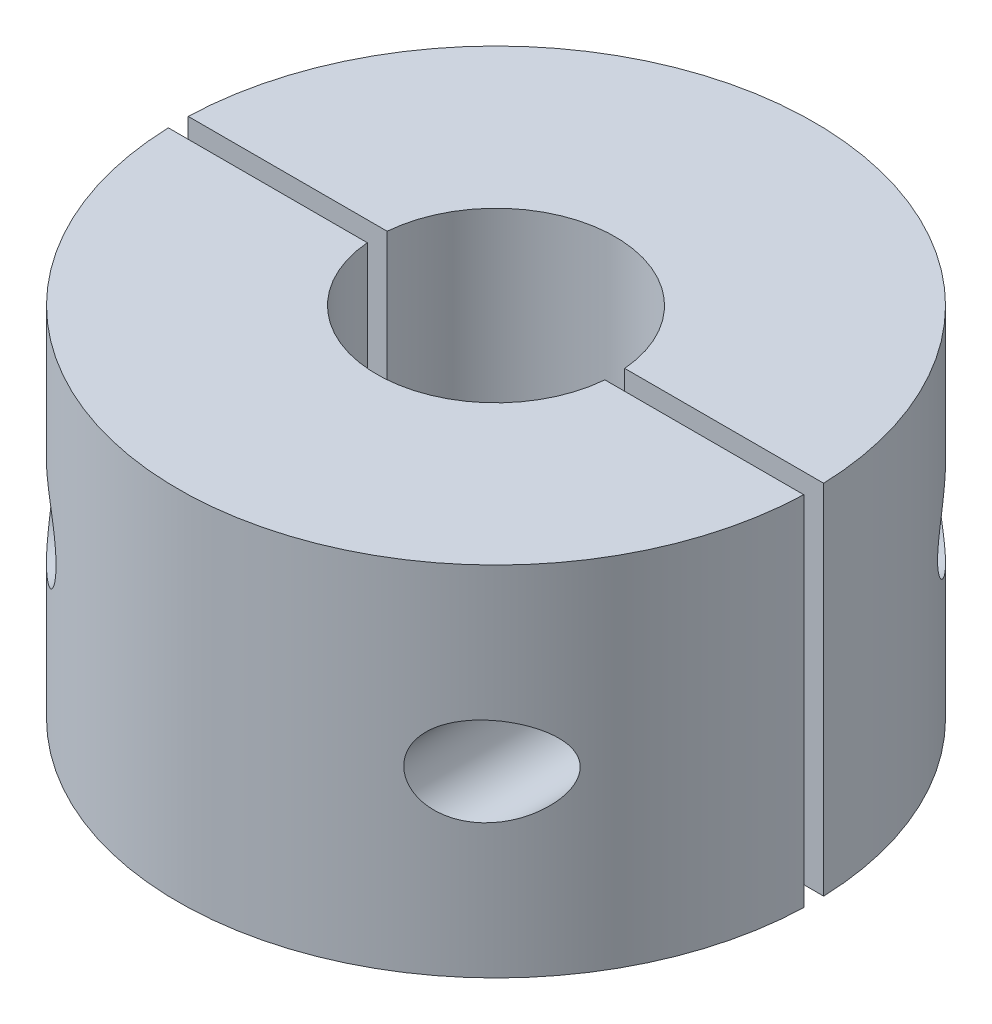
from build123d import *

# Parameters (mm, degrees)
SKETCH_1_R               = 8
EXTRUDE_1_DEPTH          = 9
SKETCH_3_R               = 3
CUT_EXTRUDE_2_DEPTH      = 15.456832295
SKETCH_5_W               = 20
SKETCH_5_H               = 0.5
CUT_EXTRUDE_4_DEPTH      = 15.456832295
CUT_EXTRUDE_5_DEPTH      = 15.454670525
CUT_EXTRUDE_5_DEPTH_BACK = 15.454670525
SKETCH_6_R               = 1.12021095


with BuildPart() as part:
    # Sketch 1 → Extrude 1 (new body)
    with BuildSketch(Plane(origin=(0, 0, 0), x_dir=(1, 0, 0), z_dir=(0, 1, 0))):
        with Locations(Location((0, 0, 0), (0, 0, 270))):
            Circle(SKETCH_1_R)
    extrude(amount=EXTRUDE_1_DEPTH)

    # Sketch 3 → Cut-Extrude 2 (cut, through all)
    with BuildSketch(Plane(origin=(0, 9, 0), x_dir=(1, 0, 0), z_dir=(0, 1, 0))):
        with Locations(Location((0, 0, 0), (0, 0, 270))):
            Circle(SKETCH_3_R)
    extrude(amount=-CUT_EXTRUDE_2_DEPTH, mode=Mode.SUBTRACT)

    # Sketch 5 → Cut-Extrude 4 (cut, through all)
    with BuildSketch(Plane(origin=(0, 9, 0), x_dir=(1, 0, 0), z_dir=(0, 1, 0))):
        Rectangle(SKETCH_5_W, SKETCH_5_H)
    extrude(amount=-CUT_EXTRUDE_4_DEPTH, mode=Mode.SUBTRACT)


with BuildPart() as cut_extrude_4_piece_1:
    # of the separate pieces the step leaves, piece 1, a body of its own (cut_extrude_4_pieces)
    add(part.part.solids().sort_by_distance((-7.996092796, 0, 0.25))[0])


with BuildPart() as cut_extrude_4_piece_2:
    # of the separate pieces the step leaves, piece 2, a body of its own (cut_extrude_4_pieces)
    add(part.part.solids().sort_by_distance((7.996092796, 0, -0.25))[0])


with BuildPart() as cut_extrude_5_tool:
    # Sketch 6 → Cut-Extrude 5 (new, two sides: drawn at the far end of the back side and taken through both)
    with BuildSketch(Plane.XY.offset(-CUT_EXTRUDE_5_DEPTH_BACK)):
        with Locations((5.496092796, 4.5)):
            Circle(SKETCH_6_R)
        with Locations((-5.496092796, 4.5)):
            Circle(SKETCH_6_R)
    extrude(amount=CUT_EXTRUDE_5_DEPTH + CUT_EXTRUDE_5_DEPTH_BACK)


with BuildPart() as cut_extrude_4_piece_1_1:
    add(cut_extrude_4_piece_1.part)

    # Cut-Extrude 5: cut by cut_extrude_5_tool
    add(cut_extrude_5_tool.part, mode=Mode.SUBTRACT)


with BuildPart() as cut_extrude_4_piece_2_1:
    add(cut_extrude_4_piece_2.part)

    # Cut-Extrude 5: cut by cut_extrude_5_tool
    add(cut_extrude_5_tool.part, mode=Mode.SUBTRACT)


solid = Compound([cut_extrude_4_piece_1_1.part, cut_extrude_4_piece_2_1.part])
